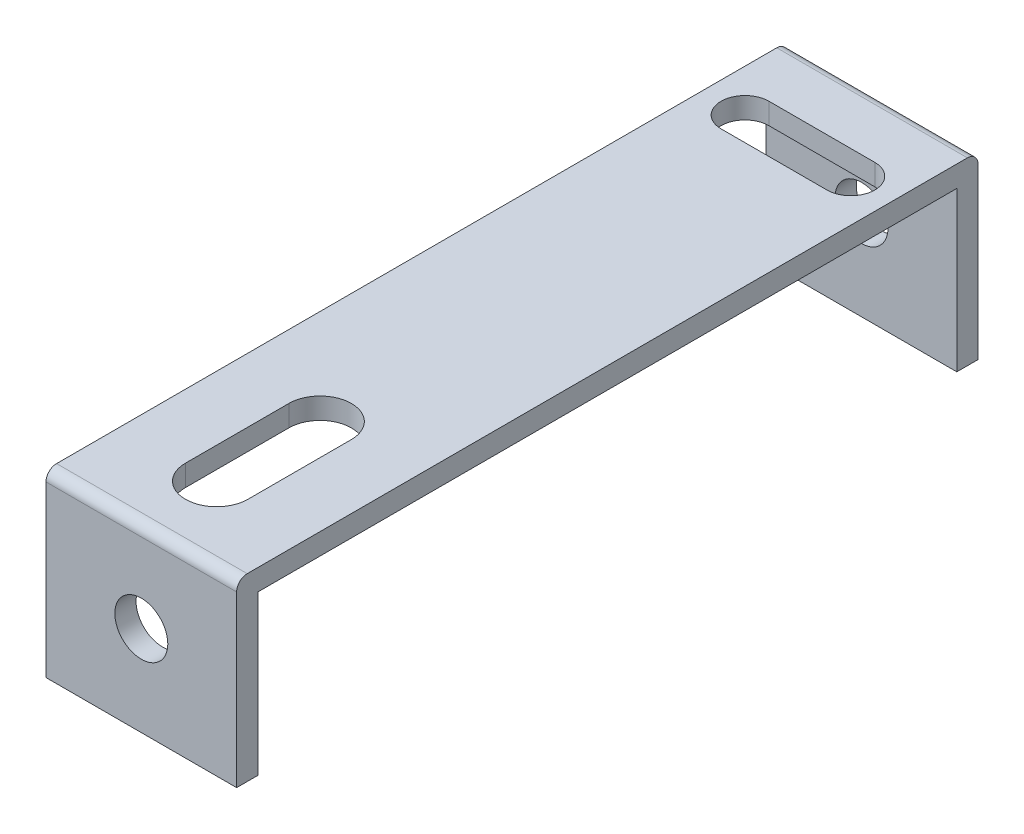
from build123d import *

# Parameters (mm, degrees)
SALIENTE_EXTRUIR1_DEPTH    = 18
CORTAR_EXTRUIR1_DEPTH      = 46.354161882
CORTAR_EXTRUIR1_DEPTH_BACK = 46.354161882
CROQUIS3_R                 = 2.5
REDONDEO1_R                = 1
CORTAR_EXTRUIR2_DEPTH      = 10


with BuildPart() as part:
    # Croquis2 → Saliente-Extruir1 (new body)
    with BuildSketch(Plane(origin=(0, 0, 0), x_dir=(0, 0, -1), z_dir=(1, 0, 0))):
        Polygon((-32, 0), (38, 0), (38, -17), (36, -17), (36, -2), (-30, -2), (-30, -17), (-32, -17), align=None)
    extrude(amount=SALIENTE_EXTRUIR1_DEPTH)

    # Croquis3 → Cortar-Extruir1 (cut, two sides: drawn at the far end of the back side and taken through both)
    with BuildSketch(Plane.XY.offset(-CORTAR_EXTRUIR1_DEPTH_BACK)):
        with Locations((9, -8.5)):
            Circle(CROQUIS3_R)
    extrude(amount=CORTAR_EXTRUIR1_DEPTH + CORTAR_EXTRUIR1_DEPTH_BACK, mode=Mode.SUBTRACT)

    # Redondeo1
    redondeo1_edges = [part.edges().sort_by_distance(p)[0] for p in [
        (9, 0, 32),
        (9, 0, -38),
    ]]
    fillet(redondeo1_edges, radius=REDONDEO1_R)

    # Croquis4 → Cortar-Extruir2 (cut)
    with BuildSketch(Plane(origin=(0, 0, 0), x_dir=(1, 0, 0), z_dir=(0, 1, 0))):
        with BuildLine():
            Line((14, 27.740466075), (4, 27.740466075))
            ThreePointArc((4, 27.740466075), (1.740466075, 30), (4, 32.259533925))
            Line((4, 32.259533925), (14, 32.259533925))
            ThreePointArc((14, 32.259533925), (16.259533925, 30), (14, 27.740466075))
        make_face()
        with BuildLine():
            Line((6.048319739, -24.884055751), (6.048319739, -15.115944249))
            ThreePointArc((6.048319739, -15.115944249), (9, -12.164263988), (11.951680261, -15.115944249))
            Line((11.951680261, -15.115944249), (11.951680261, -24.884055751))
            ThreePointArc((11.951680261, -24.884055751), (9, -27.835736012), (6.048319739, -24.884055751))
        make_face()
    extrude(amount=-CORTAR_EXTRUIR2_DEPTH, mode=Mode.SUBTRACT)


solid = part.part
